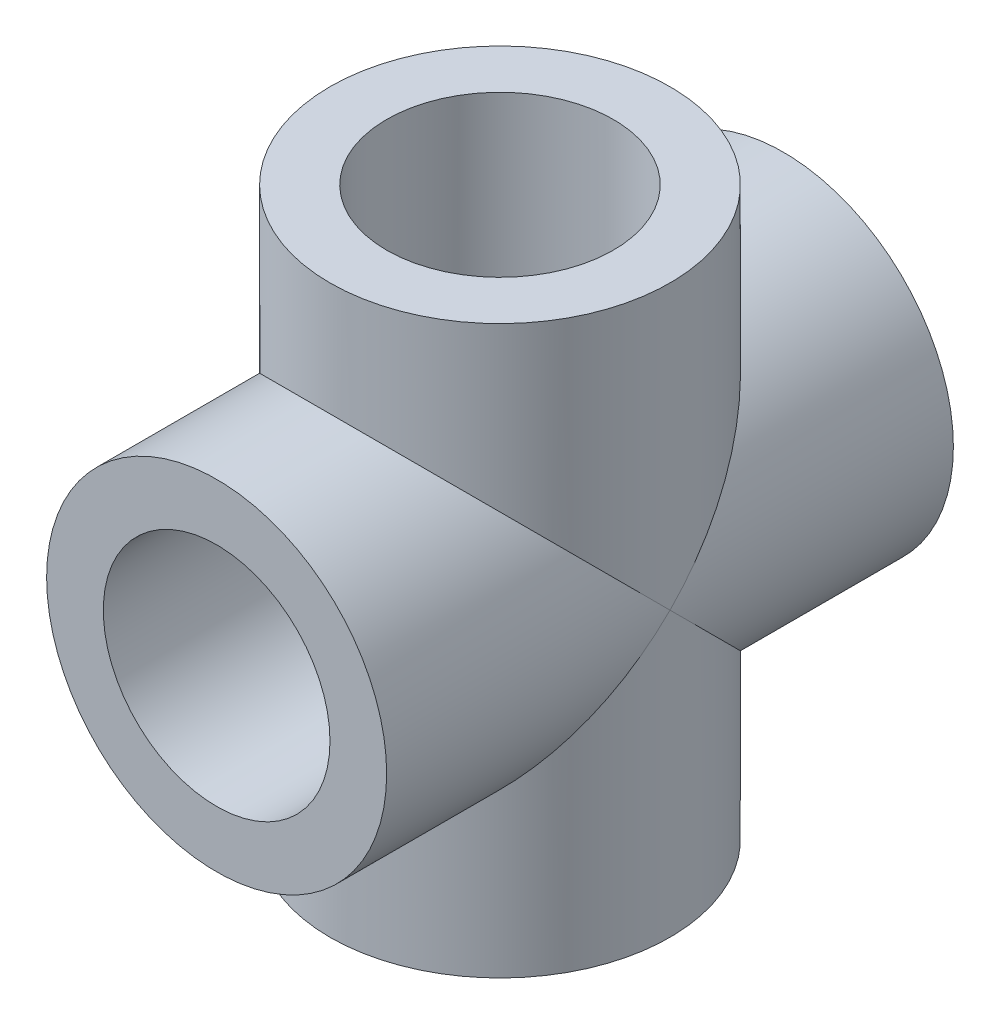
from build123d import *

# Parameters (mm, degrees)
SKETCH_1_R          = 6
EXTRUDE_1_DEPTH     = 20
SKETCH_2_R          = 6
EXTRUDE_2_DEPTH     = 10
SKETCH_3_R          = 4
CUT_EXTRUDE_1_DEPTH = 10
SKETCH_4_R          = 4
CUT_EXTRUDE_2_DEPTH = 20


with BuildPart() as part:
    # Sketch 1 → Extrude 1 (new body)
    with BuildSketch(Plane(origin=(0, 0, 0), x_dir=(1, 0, 0), z_dir=(0, 1, 0))):
        with Locations(Location((0, 0, 0), (0, 0, 270))):
            Circle(SKETCH_1_R)
    extrude(amount=EXTRUDE_1_DEPTH)

    # Sketch 2 → Extrude 2 (add, symmetric)
    with BuildSketch(Plane.XY):
        with Locations((0, 10)):
            Circle(SKETCH_2_R)
    extrude(amount=EXTRUDE_2_DEPTH, both=True)

    # Sketch 3 → Cut-Extrude 1 (cut, symmetric)
    with BuildSketch(Plane.XY):
        with Locations((0, 10)):
            Circle(SKETCH_3_R)
    extrude(amount=CUT_EXTRUDE_1_DEPTH, both=True, mode=Mode.SUBTRACT)

    # Sketch 4 → Cut-Extrude 2 (cut, symmetric)
    with BuildSketch(Plane(origin=(0, 0, 0), x_dir=(1, 0, 0), z_dir=(0, 1, 0))):
        with Locations(Location((0, 0, 0), (0, 0, 270))):
            Circle(SKETCH_4_R)
    extrude(amount=CUT_EXTRUDE_2_DEPTH, both=True, mode=Mode.SUBTRACT)


solid = part.part
